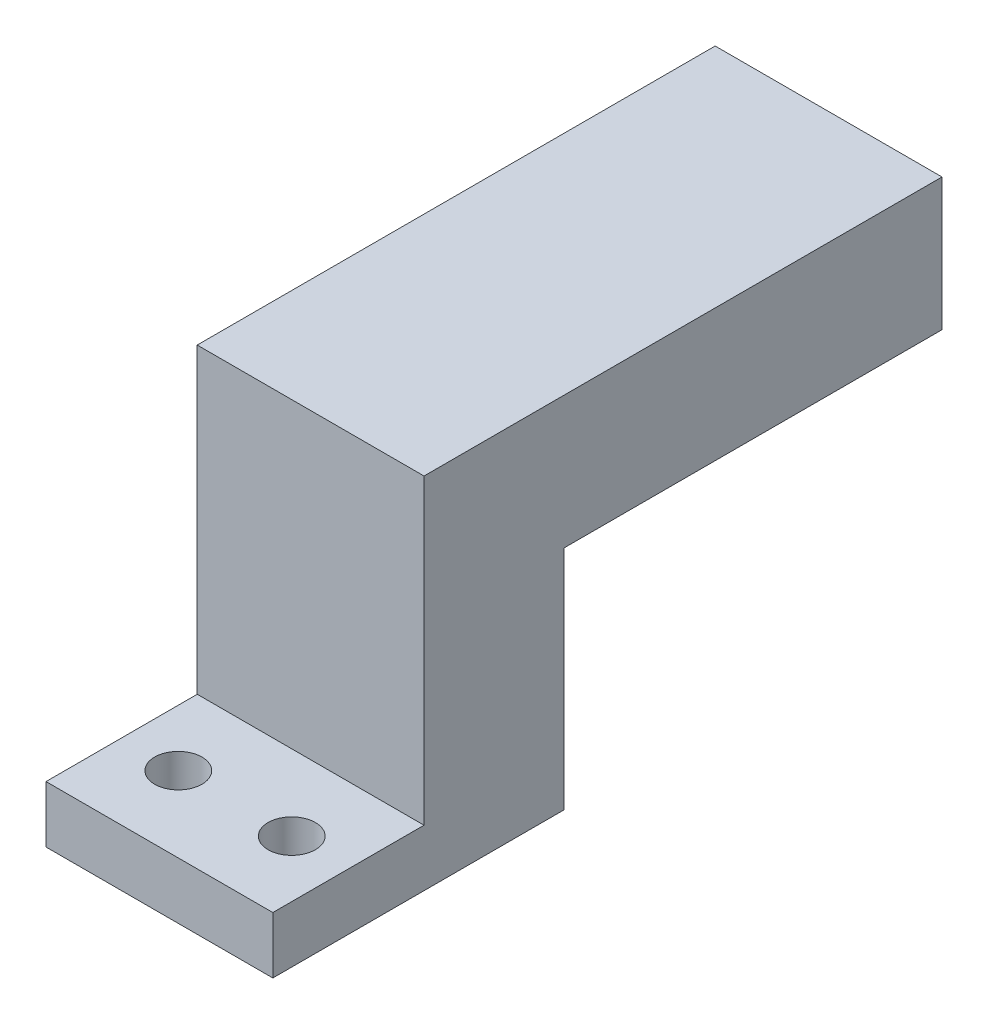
from build123d import *

# Parameters (mm, degrees)
BOSS_EXTRUDE1_DEPTH = 12
SKETCH2_R           = 1.25
CUT_EXTRUDE1_DEPTH  = 12


with BuildPart() as part:
    # Sketch1 → Boss-Extrude1 (new body)
    with BuildSketch(Plane(origin=(0, 0, 0), x_dir=(0, 0, -1), z_dir=(1, 0, 0))):
        Polygon((0, 0), (15.402101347, 0), (15.402101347, 12), (35.402101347, 12), (35.402101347, 19), (8, 19), (8, 3), (0, 3), align=None)
    extrude(amount=BOSS_EXTRUDE1_DEPTH)

    # Sketch2 → Cut-Extrude1 (cut)
    with BuildSketch(Plane(origin=(0, 3, 0), x_dir=(1, 0, 0), z_dir=(0, 1, 0))):
        with Locations(Location((3, 4, 0), (0, 0, 270))):
            Circle(SKETCH2_R)
        with Locations(Location((9, 4, 0), (0, 0, 270))):
            Circle(SKETCH2_R)
    extrude(amount=-CUT_EXTRUDE1_DEPTH, mode=Mode.SUBTRACT)


solid = part.part
